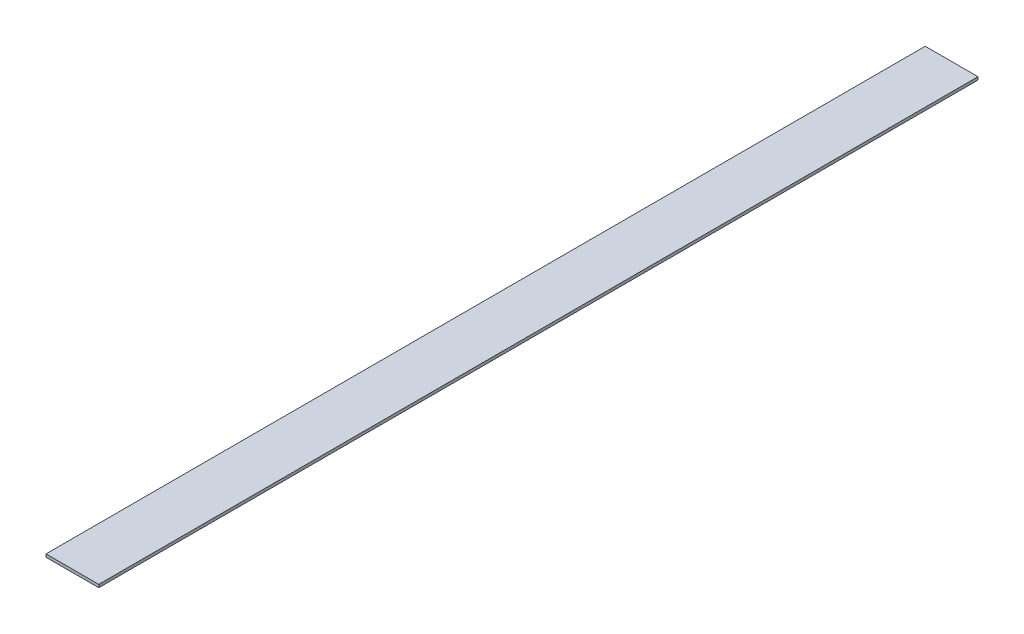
from build123d import *

# Parameters (mm, degrees)
ESQUISSE1_W          = 90
ESQUISSE1_H          = 5
BASE_EXTRUSION_DEPTH = 1500


with BuildPart() as part:
    # Esquisse1 → Base-Extrusion (new body)
    with BuildSketch(Plane.XY):
        with Locations((45, -2.5)):
            Rectangle(ESQUISSE1_W, ESQUISSE1_H)
    extrude(amount=BASE_EXTRUSION_DEPTH)


solid = part.part
